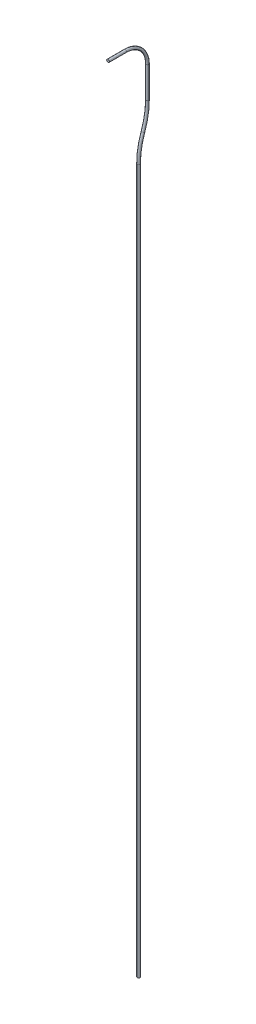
ISO-10303-21;
HEADER;
FILE_DESCRIPTION(('STEP AP214'),'2;1');
FILE_NAME('part.step','',(''),(''),'','','');
FILE_SCHEMA(('AUTOMOTIVE_DESIGN { 1 0 10303 214 1 1 1 1 }'));
ENDSEC;
DATA;
#1=APPLICATION_CONTEXT('core data for automotive mechanical design processes');
#2=APPLICATION_PROTOCOL_DEFINITION('international standard','automotive_design',2000,#1);
#3=PRODUCT_CONTEXT('',#1,'mechanical');
#4=PRODUCT('Part','Part','',(#3));
#5=PRODUCT_RELATED_PRODUCT_CATEGORY('part','',(#4));
#6=PRODUCT_DEFINITION_FORMATION('','',#4);
#7=PRODUCT_DEFINITION_CONTEXT('part definition',#1,'design');
#8=PRODUCT_DEFINITION('design','',#6,#7);
#9=PRODUCT_DEFINITION_SHAPE('','',#8);
#10=(LENGTH_UNIT() NAMED_UNIT(*) SI_UNIT(.MILLI.,.METRE.));
#11=(NAMED_UNIT(*) PLANE_ANGLE_UNIT() SI_UNIT($,.RADIAN.));
#12=(NAMED_UNIT(*) SI_UNIT($,.STERADIAN.) SOLID_ANGLE_UNIT());
#13=UNCERTAINTY_MEASURE_WITH_UNIT(LENGTH_MEASURE(1.E-05),#10,'distance_accuracy_value','');
#14=(GEOMETRIC_REPRESENTATION_CONTEXT(3) GLOBAL_UNCERTAINTY_ASSIGNED_CONTEXT((#13)) GLOBAL_UNIT_ASSIGNED_CONTEXT((#10,
#11,#12)) REPRESENTATION_CONTEXT('',''));
#15=CARTESIAN_POINT('',(0.,0.,0.));
#16=DIRECTION('',(0.,0.,1.));
#17=DIRECTION('',(1.,0.,0.));
#18=AXIS2_PLACEMENT_3D('',#15,#16,#17);
#19=CARTESIAN_POINT('',(0.,-310.,-4.5));
#20=DIRECTION('',(0.,1.,0.));
#21=DIRECTION('',(0.,0.,-1.));
#22=AXIS2_PLACEMENT_3D('',#19,#20,#21);
#23=PLANE('',#22);
#24=CARTESIAN_POINT('',(0.,-310.,-4.5));
#25=DIRECTION('',(0.,1.,0.));
#26=DIRECTION('',(0.,0.,1.));
#27=AXIS2_PLACEMENT_3D('',#24,#25,#26);
#28=CIRCLE('',#27,0.45);
#29=CARTESIAN_POINT('',(0.,-310.,-4.05));
#30=VERTEX_POINT('',#29);
#31=EDGE_CURVE('E93',#30,#30,#28,.T.);
#32=ORIENTED_EDGE('',*,*,#31,.F.);
#33=EDGE_LOOP('',(#32));
#34=FACE_BOUND('',#33,.T.);
#35=ADVANCED_FACE('F16',(#34),#23,.F.);
#36=CARTESIAN_POINT('',(0.,-36.565,5.83));
#37=DIRECTION('',(0.,0.,1.));
#38=DIRECTION('',(0.,-1.,0.));
#39=AXIS2_PLACEMENT_3D('',#36,#37,#38);
#40=PLANE('',#39);
#41=CARTESIAN_POINT('',(0.,-36.565,5.83));
#42=DIRECTION('',(0.,0.,1.));
#43=DIRECTION('',(0.,-1.,0.));
#44=AXIS2_PLACEMENT_3D('',#41,#42,#43);
#45=CIRCLE('',#44,0.45);
#46=CARTESIAN_POINT('',(0.,-37.015,5.83));
#47=VERTEX_POINT('',#46);
#48=EDGE_CURVE('E10',#47,#47,#45,.T.);
#49=ORIENTED_EDGE('',*,*,#48,.T.);
#50=EDGE_LOOP('',(#49));
#51=FACE_BOUND('',#50,.T.);
#52=ADVANCED_FACE('F127',(#51),#40,.T.);
#53=CARTESIAN_POINT('',(0.,-36.565,0.));
#54=DIRECTION('',(0.,0.,1.));
#55=DIRECTION('',(0.,-1.,0.));
#56=AXIS2_PLACEMENT_3D('',#53,#54,#55);
#57=CYLINDRICAL_SURFACE('',#56,0.45);
#58=CARTESIAN_POINT('',(0.,-36.565,0.));
#59=DIRECTION('',(0.,0.,-1.));
#60=DIRECTION('',(0.,1.,0.));
#61=AXIS2_PLACEMENT_3D('',#58,#59,#60);
#62=CIRCLE('',#61,0.45);
#63=CARTESIAN_POINT('',(0.,-37.015,0.));
#64=VERTEX_POINT('',#63);
#65=EDGE_CURVE('E112',#64,#64,#62,.T.);
#66=ORIENTED_EDGE('',*,*,#65,.F.);
#67=DIRECTION('',(0.,0.,1.));
#68=VECTOR('',#67,1.);
#69=CARTESIAN_POINT('',(0.,-37.015,0.));
#70=LINE('',#69,#68);
#71=EDGE_CURVE('E26',#64,#47,#70,.T.);
#72=ORIENTED_EDGE('',*,*,#71,.T.);
#73=ORIENTED_EDGE('',*,*,#48,.F.);
#74=ORIENTED_EDGE('',*,*,#71,.F.);
#75=EDGE_LOOP('',(#66,#72,#73,#74));
#76=FACE_BOUND('',#75,.T.);
#77=ADVANCED_FACE('F18',(#76),#57,.T.);
#78=CARTESIAN_POINT('',(0.,-44.065,0.));
#79=DIRECTION('',(1.,0.,0.));
#80=DIRECTION('',(0.,0.,-1.));
#81=AXIS2_PLACEMENT_3D('',#78,#79,#80);
#82=TOROIDAL_SURFACE('',#81,7.5,0.45);
#83=CARTESIAN_POINT('',(0.,-44.065,0.));
#84=DIRECTION('',(1.,0.,0.));
#85=DIRECTION('',(0.,0.,-1.));
#86=AXIS2_PLACEMENT_3D('',#83,#84,#85);
#87=CIRCLE('',#86,7.05);
#88=CARTESIAN_POINT('',(0.,-44.065,-7.05));
#89=VERTEX_POINT('',#88);
#90=EDGE_CURVE('E109',#89,#64,#87,.T.);
#91=ORIENTED_EDGE('',*,*,#90,.T.);
#92=ORIENTED_EDGE('',*,*,#65,.T.);
#93=ORIENTED_EDGE('',*,*,#90,.F.);
#94=CARTESIAN_POINT('',(0.,-44.065,-7.5));
#95=DIRECTION('',(0.,1.,0.));
#96=DIRECTION('',(0.,0.,1.));
#97=AXIS2_PLACEMENT_3D('',#94,#95,#96);
#98=CIRCLE('',#97,0.45);
#99=EDGE_CURVE('E74',#89,#89,#98,.T.);
#100=ORIENTED_EDGE('',*,*,#99,.T.);
#101=EDGE_LOOP('',(#91,#92,#93,#100));
#102=FACE_BOUND('',#101,.T.);
#103=ADVANCED_FACE('F118',(#102),#82,.T.);
#104=CARTESIAN_POINT('',(0.,-54.6,-7.5));
#105=DIRECTION('',(0.,1.,0.));
#106=DIRECTION('',(0.,0.,1.));
#107=AXIS2_PLACEMENT_3D('',#104,#105,#106);
#108=CYLINDRICAL_SURFACE('',#107,0.45);
#109=CARTESIAN_POINT('',(0.,-54.6,-7.5));
#110=DIRECTION('',(0.,-1.,0.));
#111=DIRECTION('',(0.,0.,-1.));
#112=AXIS2_PLACEMENT_3D('',#109,#110,#111);
#113=CIRCLE('',#112,0.45);
#114=CARTESIAN_POINT('',(0.,-54.6,-7.05));
#115=VERTEX_POINT('',#114);
#116=EDGE_CURVE('E71',#115,#115,#113,.T.);
#117=ORIENTED_EDGE('',*,*,#116,.F.);
#118=DIRECTION('',(0.,1.,0.));
#119=VECTOR('',#118,1.);
#120=CARTESIAN_POINT('',(0.,-54.6,-7.05));
#121=LINE('',#120,#119);
#122=EDGE_CURVE('E68',#115,#89,#121,.T.);
#123=ORIENTED_EDGE('',*,*,#122,.T.);
#124=ORIENTED_EDGE('',*,*,#99,.F.);
#125=ORIENTED_EDGE('',*,*,#122,.F.);
#126=EDGE_LOOP('',(#117,#123,#124,#125));
#127=FACE_BOUND('',#126,.T.);
#128=ADVANCED_FACE('F70',(#127),#108,.T.);
#129=CARTESIAN_POINT('',(0.,-54.6,17.903333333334));
#130=DIRECTION('',(1.,0.,0.));
#131=DIRECTION('',(0.,-0.338538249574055,-0.940952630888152));
#132=AXIS2_PLACEMENT_3D('',#129,#130,#131);
#133=TOROIDAL_SURFACE('',#132,25.403333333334,0.45);
#134=CARTESIAN_POINT('',(0.,-54.6,17.903333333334));
#135=DIRECTION('',(1.,0.,0.));
#136=DIRECTION('',(0.,-0.338538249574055,-0.940952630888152));
#137=AXIS2_PLACEMENT_3D('',#134,#135,#136);
#138=CIRCLE('',#137,24.953333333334);
#139=CARTESIAN_POINT('',(0.,-63.04765778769,-5.5765713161));
#140=VERTEX_POINT('',#139);
#141=EDGE_CURVE('E80',#140,#115,#138,.T.);
#142=ORIENTED_EDGE('',*,*,#141,.T.);
#143=ORIENTED_EDGE('',*,*,#116,.T.);
#144=ORIENTED_EDGE('',*,*,#141,.F.);
#145=CARTESIAN_POINT('',(0.,-63.2,-6.));
#146=DIRECTION('',(0.,-0.940952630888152,0.338538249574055));
#147=DIRECTION('',(0.,0.338538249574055,0.940952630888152));
#148=AXIS2_PLACEMENT_3D('',#145,#146,#147);
#149=CIRCLE('',#148,0.45);
#150=EDGE_CURVE('E87',#140,#140,#149,.T.);
#151=ORIENTED_EDGE('',*,*,#150,.F.);
#152=EDGE_LOOP('',(#142,#143,#144,#151));
#153=FACE_BOUND('',#152,.T.);
#154=ADVANCED_FACE('F78',(#153),#133,.T.);
#155=CARTESIAN_POINT('',(0.,-71.8,-29.90333333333));
#156=DIRECTION('',(-1.,0.,0.));
#157=DIRECTION('',(0.,0.,1.));
#158=AXIS2_PLACEMENT_3D('',#155,#156,#157);
#159=TOROIDAL_SURFACE('',#158,25.403333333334,0.45);
#160=CARTESIAN_POINT('',(0.,-71.8,-29.90333333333));
#161=DIRECTION('',(-1.,0.,0.));
#162=DIRECTION('',(0.,0.,1.));
#163=AXIS2_PLACEMENT_3D('',#160,#161,#162);
#164=CIRCLE('',#163,25.853333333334);
#165=CARTESIAN_POINT('',(0.,-71.8,-4.05));
#166=VERTEX_POINT('',#165);
#167=EDGE_CURVE('E95',#166,#140,#164,.T.);
#168=ORIENTED_EDGE('',*,*,#167,.T.);
#169=ORIENTED_EDGE('',*,*,#150,.T.);
#170=ORIENTED_EDGE('',*,*,#167,.F.);
#171=CARTESIAN_POINT('',(0.,-71.8,-4.5));
#172=DIRECTION('',(0.,1.,0.));
#173=DIRECTION('',(0.,0.,1.));
#174=AXIS2_PLACEMENT_3D('',#171,#172,#173);
#175=CIRCLE('',#174,0.45);
#176=EDGE_CURVE('E20',#166,#166,#175,.T.);
#177=ORIENTED_EDGE('',*,*,#176,.T.);
#178=EDGE_LOOP('',(#168,#169,#170,#177));
#179=FACE_BOUND('',#178,.T.);
#180=ADVANCED_FACE('F145',(#179),#159,.T.);
#181=CARTESIAN_POINT('',(0.,-310.,-4.5));
#182=DIRECTION('',(0.,1.,0.));
#183=DIRECTION('',(0.,0.,1.));
#184=AXIS2_PLACEMENT_3D('',#181,#182,#183);
#185=CYLINDRICAL_SURFACE('',#184,0.45);
#186=DIRECTION('',(0.,1.,0.));
#187=VECTOR('',#186,1.);
#188=CARTESIAN_POINT('',(0.,-310.,-4.05));
#189=LINE('',#188,#187);
#190=EDGE_CURVE('E90',#30,#166,#189,.T.);
#191=ORIENTED_EDGE('',*,*,#190,.T.);
#192=ORIENTED_EDGE('',*,*,#176,.F.);
#193=ORIENTED_EDGE('',*,*,#190,.F.);
#194=ORIENTED_EDGE('',*,*,#31,.T.);
#195=EDGE_LOOP('',(#191,#192,#193,#194));
#196=FACE_BOUND('',#195,.T.);
#197=ADVANCED_FACE('F141',(#196),#185,.T.);
#198=CLOSED_SHELL('',(#35,#52,#77,#103,#128,#154,#180,#197));
#199=MANIFOLD_SOLID_BREP('B1',#198);
#200=ADVANCED_BREP_SHAPE_REPRESENTATION('',(#18,#199),#14);
#201=SHAPE_DEFINITION_REPRESENTATION(#9,#200);
ENDSEC;
END-ISO-10303-21;
